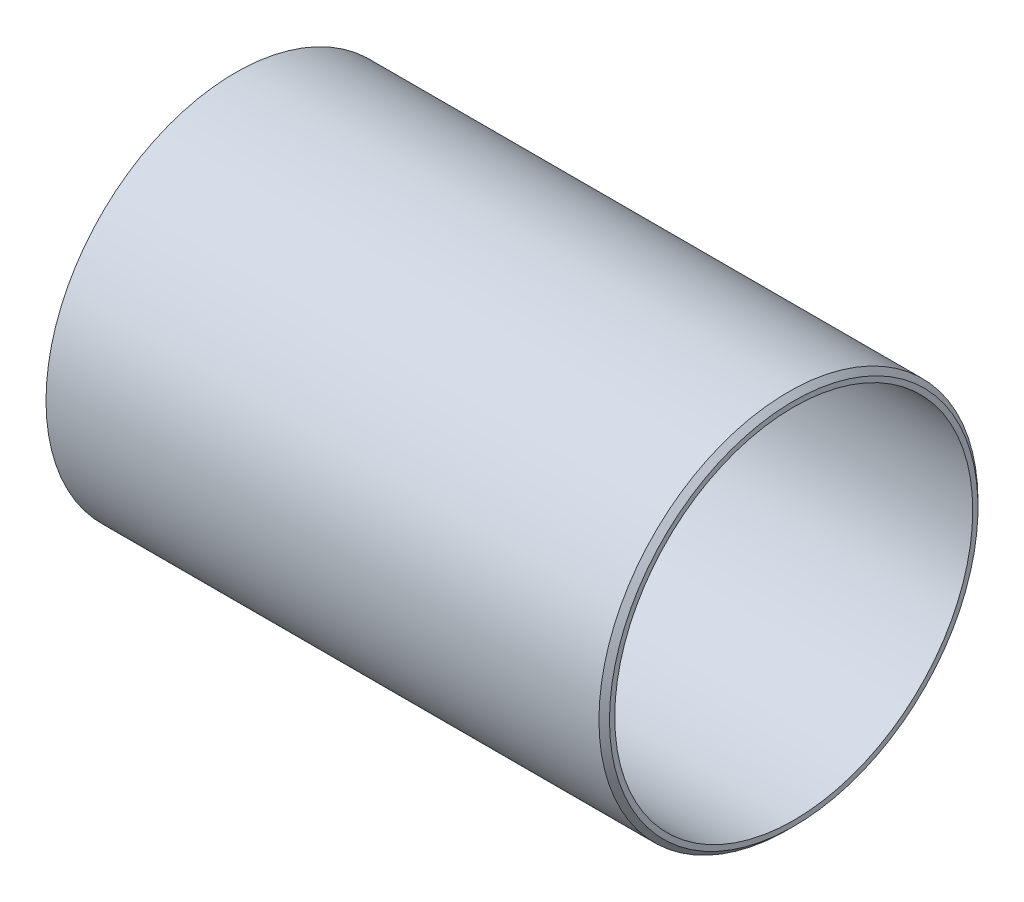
from build123d import *

# Parameters (mm, degrees)
SKETCH2_R      = 114.3
SKETCH2_R_2    = 107.95
EXTRUDE2_DEPTH = 336.65
CHAMFER1_SIZE  = 3.175


with BuildPart() as part:
    # Sketch2 → Extrude2 (new body)
    with BuildSketch(Plane(origin=(0, 0, 0), x_dir=(0, 1, 0), z_dir=(-1, 0, 0))):
        with Locations(Location((0, 0, 0), (0, 0, 90))):
            Circle(SKETCH2_R)
        with Locations(Location((0, 0, 0), (0, 0, 90))):
            Circle(SKETCH2_R_2, mode=Mode.SUBTRACT)
    extrude(amount=EXTRUDE2_DEPTH)

    # Chamfer1
    chamfer1_edges = [part.edges().sort_by_distance(p)[0] for p in [
        (0, 0, 114.3),
    ]]
    chamfer(chamfer1_edges, length=CHAMFER1_SIZE)


solid = part.part
